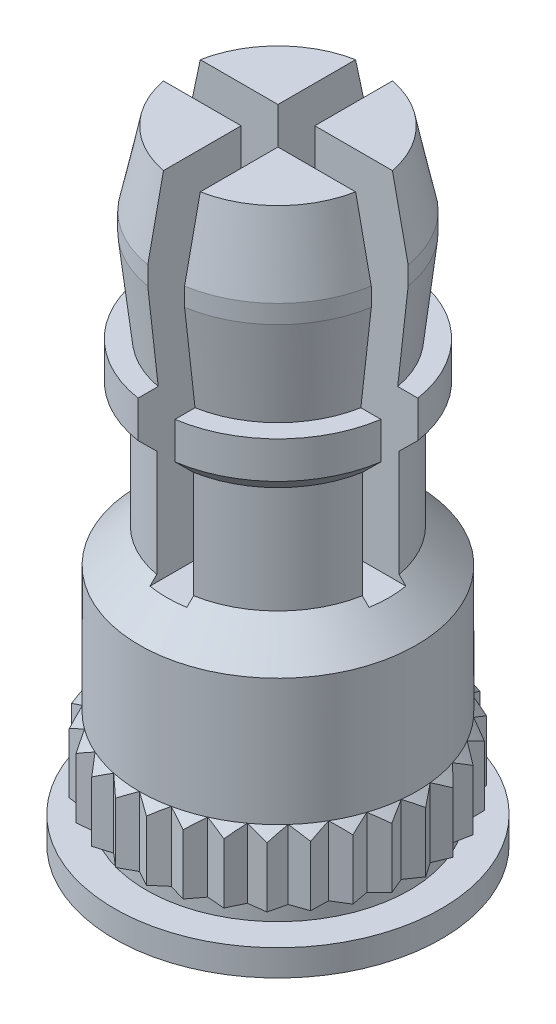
from build123d import *

# Parameters (mm, degrees)
SLITCUTSKE_W       = 5.33220965
SLITCUTSKE_H       = 0.7155
SLITCUT_DEPTH      = 6.8582
SLITCUTPAT_COUNT   = 2
SLITCUTPAT_ANGLE   = 90
CLINCHCUT_START    = -1.345
CLINCHCUT_DEPTH    = 1.345
CLINCHCUTPAT_COUNT = 30
CLINCHCUTPAT_ANGLE = 348


with BuildPart() as part:
    # BodySke → Body (revolve)
    with BuildSketch(Plane.XY, mode=Mode.PRIVATE) as body_sk:
        Polygon((2.5555, 0), (2.5555, 0.3825), (2.87, 0.3825), (2.87, 1.5475), (2.69, 1.7275), (2.69, 4.18905), (2.02725, 4.8518), (2.02725, 6.92675), (2.385, 7.2845), (2.385, 8), (2, 8), (2.2, 9.79), (2.2, 10.148), (1.9, 11.58), (0, 11.58), (0, -0.51), (3.175, -0.51), (3.175, 0), align=None)
    revolve(body_sk.sketch.rotate(Axis((0, -0.51, 0), (0, 1, 0)), 90), axis=Axis((0, -0.51, 0), (0, 1, 0)))

    # SlitCutSke → SlitCut (cut)
    with BuildSketch(Plane(origin=(0, 11.58, 0), x_dir=(-1, 0, 0), z_dir=(0, 1, 0))):
        Rectangle(SLITCUTSKE_W, SLITCUTSKE_H)
    slitcut = extrude(amount=-SLITCUT_DEPTH, mode=Mode.SUBTRACT)

    # SlitCutPat: SlitCut ×2 about axis
    slitcutpat_axis = Axis((0, -0.51, 0), (0, 1, 0))
    for i in range(1, SLITCUTPAT_COUNT):
        add(slitcut.rotate(slitcutpat_axis, i * SLITCUTPAT_ANGLE / (SLITCUTPAT_COUNT - 1)), mode=Mode.SUBTRACT)

    # CliRinCutSke → ClinchCut (cut)
    with BuildSketch(Plane.XZ.offset(-0.3825).offset(CLINCHCUT_START)):
        with BuildLine():
            Line((0.29999669, 2.85427784), (0, 2.69))
            Line((0, 2.69), (-0.29999669, 2.85427784))
            ThreePointArc((-0.29999669, 2.85427784), (0, 2.87), (0.29999669, 2.85427784))
        make_face()
    clinchcut = extrude(amount=CLINCHCUT_DEPTH, mode=Mode.SUBTRACT)

    # ClinchCutPat: ClinchCut ×30 about axis
    clinchcutpat_axis = Axis((0, -0.51, 0), (0, 1, 0))
    for i in range(1, CLINCHCUTPAT_COUNT):
        add(clinchcut.rotate(clinchcutpat_axis, i * CLINCHCUTPAT_ANGLE / (CLINCHCUTPAT_COUNT - 1)), mode=Mode.SUBTRACT)


solid = part.part
